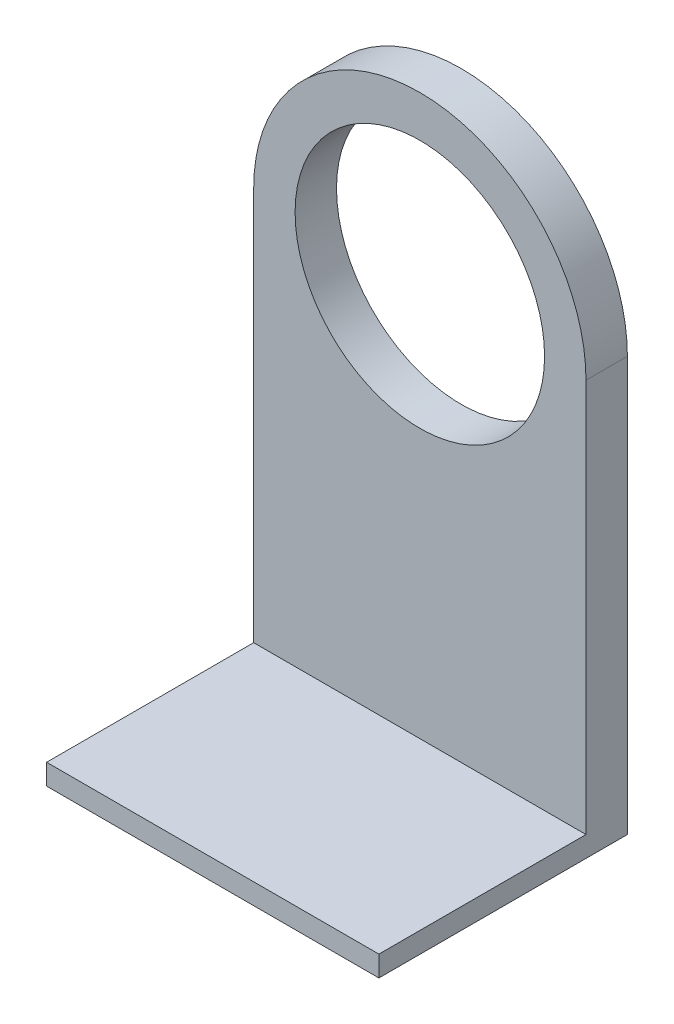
ISO-10303-21;
HEADER;
FILE_DESCRIPTION(('STEP AP214'),'2;1');
FILE_NAME('part.step','',(''),(''),'','','');
FILE_SCHEMA(('AUTOMOTIVE_DESIGN { 1 0 10303 214 1 1 1 1 }'));
ENDSEC;
DATA;
#1=APPLICATION_CONTEXT('core data for automotive mechanical design processes');
#2=APPLICATION_PROTOCOL_DEFINITION('international standard','automotive_design',2000,#1);
#3=PRODUCT_CONTEXT('',#1,'mechanical');
#4=PRODUCT('Part','Part','',(#3));
#5=PRODUCT_RELATED_PRODUCT_CATEGORY('part','',(#4));
#6=PRODUCT_DEFINITION_FORMATION('','',#4);
#7=PRODUCT_DEFINITION_CONTEXT('part definition',#1,'design');
#8=PRODUCT_DEFINITION('design','',#6,#7);
#9=PRODUCT_DEFINITION_SHAPE('','',#8);
#10=(LENGTH_UNIT() NAMED_UNIT(*) SI_UNIT(.MILLI.,.METRE.));
#11=(NAMED_UNIT(*) PLANE_ANGLE_UNIT() SI_UNIT($,.RADIAN.));
#12=(NAMED_UNIT(*) SI_UNIT($,.STERADIAN.) SOLID_ANGLE_UNIT());
#13=UNCERTAINTY_MEASURE_WITH_UNIT(LENGTH_MEASURE(1.E-05),#10,'distance_accuracy_value','');
#14=(GEOMETRIC_REPRESENTATION_CONTEXT(3) GLOBAL_UNCERTAINTY_ASSIGNED_CONTEXT((#13)) GLOBAL_UNIT_ASSIGNED_CONTEXT((#10,
#11,#12)) REPRESENTATION_CONTEXT('',''));
#15=CARTESIAN_POINT('',(0.,0.,0.));
#16=DIRECTION('',(0.,0.,1.));
#17=DIRECTION('',(1.,0.,0.));
#18=AXIS2_PLACEMENT_3D('',#15,#16,#17);
#19=CARTESIAN_POINT('',(0.,-1.83880688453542E-13,12.6999999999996));
#20=DIRECTION('',(0.,0.,1.));
#21=DIRECTION('',(1.,0.,0.));
#22=AXIS2_PLACEMENT_3D('',#19,#20,#21);
#23=PLANE('',#22);
#24=DIRECTION('',(-1.,0.,0.));
#25=VECTOR('',#24,1.);
#26=CARTESIAN_POINT('',(-50.95,-120.65,12.7));
#27=LINE('',#26,#25);
#28=CARTESIAN_POINT('',(50.9500000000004,-120.650000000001,12.7));
#29=VERTEX_POINT('',#28);
#30=CARTESIAN_POINT('',(-50.95,-120.65,12.7));
#31=VERTEX_POINT('',#30);
#32=EDGE_CURVE('E47',#29,#31,#27,.T.);
#33=ORIENTED_EDGE('',*,*,#32,.F.);
#34=DIRECTION('',(0.,1.,0.));
#35=VECTOR('',#34,1.);
#36=CARTESIAN_POINT('',(50.95,0.,12.6999999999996));
#37=LINE('',#36,#35);
#38=CARTESIAN_POINT('',(50.95,0.,12.6999999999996));
#39=VERTEX_POINT('',#38);
#40=EDGE_CURVE('E52',#29,#39,#37,.T.);
#41=ORIENTED_EDGE('',*,*,#40,.T.);
#42=CARTESIAN_POINT('',(0.,-1.83880688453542E-13,12.6999999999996));
#43=DIRECTION('',(0.,0.,1.));
#44=DIRECTION('',(1.,0.,0.));
#45=AXIS2_PLACEMENT_3D('',#42,#43,#44);
#46=CIRCLE('',#45,50.95);
#47=CARTESIAN_POINT('',(-50.95,-1.76941794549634E-13,12.7));
#48=VERTEX_POINT('',#47);
#49=EDGE_CURVE('E83',#39,#48,#46,.T.);
#50=ORIENTED_EDGE('',*,*,#49,.T.);
#51=DIRECTION('',(0.,-1.,0.));
#52=VECTOR('',#51,1.);
#53=CARTESIAN_POINT('',(-50.95,-1.76941794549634E-13,12.7));
#54=LINE('',#53,#52);
#55=EDGE_CURVE('E108',#48,#31,#54,.T.);
#56=ORIENTED_EDGE('',*,*,#55,.T.);
#57=EDGE_LOOP('',(#33,#41,#50,#56));
#58=FACE_BOUND('',#57,.T.);
#59=CARTESIAN_POINT('',(0.,-1.83880688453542E-13,12.6999999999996));
#60=DIRECTION('',(0.,0.,1.));
#61=DIRECTION('',(1.,0.,0.));
#62=AXIS2_PLACEMENT_3D('',#59,#60,#61);
#63=CIRCLE('',#62,38.25);
#64=CARTESIAN_POINT('',(38.25,-1.83880688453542E-13,12.6999999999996));
#65=VERTEX_POINT('',#64);
#66=EDGE_CURVE('E94',#65,#65,#63,.T.);
#67=ORIENTED_EDGE('',*,*,#66,.F.);
#68=EDGE_LOOP('',(#67));
#69=FACE_BOUND('',#68,.T.);
#70=ADVANCED_FACE('F30',(#58,#69),#23,.T.);
#71=CARTESIAN_POINT('',(0.,-1.83880688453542E-13,-3.67761376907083E-13));
#72=DIRECTION('',(0.,0.,1.));
#73=DIRECTION('',(1.,0.,0.));
#74=AXIS2_PLACEMENT_3D('',#71,#72,#73);
#75=PLANE('',#74);
#76=CARTESIAN_POINT('',(0.,-1.83880688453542E-13,-3.67761376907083E-13));
#77=DIRECTION('',(0.,0.,1.));
#78=DIRECTION('',(1.,0.,0.));
#79=AXIS2_PLACEMENT_3D('',#76,#77,#78);
#80=CIRCLE('',#79,50.95);
#81=CARTESIAN_POINT('',(50.95,-1.76941794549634E-13,-3.67761376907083E-13));
#82=VERTEX_POINT('',#81);
#83=CARTESIAN_POINT('',(-50.95,-1.76941794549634E-13,0.));
#84=VERTEX_POINT('',#83);
#85=EDGE_CURVE('E89',#82,#84,#80,.T.);
#86=ORIENTED_EDGE('',*,*,#85,.F.);
#87=DIRECTION('',(0.,1.,0.));
#88=VECTOR('',#87,1.);
#89=CARTESIAN_POINT('',(50.95,-1.76941794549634E-13,-3.67761376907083E-13));
#90=LINE('',#89,#88);
#91=CARTESIAN_POINT('',(50.95,-127.,0.));
#92=VERTEX_POINT('',#91);
#93=EDGE_CURVE('E72',#92,#82,#90,.T.);
#94=ORIENTED_EDGE('',*,*,#93,.F.);
#95=DIRECTION('',(1.,0.,0.));
#96=VECTOR('',#95,1.);
#97=CARTESIAN_POINT('',(50.95,-127.,0.));
#98=LINE('',#97,#96);
#99=CARTESIAN_POINT('',(-50.95,-127.,0.));
#100=VERTEX_POINT('',#99);
#101=EDGE_CURVE('E84',#100,#92,#98,.T.);
#102=ORIENTED_EDGE('',*,*,#101,.F.);
#103=DIRECTION('',(0.,-1.,0.));
#104=VECTOR('',#103,1.);
#105=CARTESIAN_POINT('',(-50.95,-1.76941794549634E-13,0.));
#106=LINE('',#105,#104);
#107=EDGE_CURVE('E93',#84,#100,#106,.T.);
#108=ORIENTED_EDGE('',*,*,#107,.F.);
#109=EDGE_LOOP('',(#86,#94,#102,#108));
#110=FACE_BOUND('',#109,.T.);
#111=CARTESIAN_POINT('',(0.,-1.83880688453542E-13,-3.67761376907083E-13));
#112=DIRECTION('',(0.,0.,1.));
#113=DIRECTION('',(1.,0.,0.));
#114=AXIS2_PLACEMENT_3D('',#111,#112,#113);
#115=CIRCLE('',#114,38.25);
#116=CARTESIAN_POINT('',(38.25,-1.83880688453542E-13,-3.67761376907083E-13));
#117=VERTEX_POINT('',#116);
#118=EDGE_CURVE('E98',#117,#117,#115,.T.);
#119=ORIENTED_EDGE('',*,*,#118,.T.);
#120=EDGE_LOOP('',(#119));
#121=FACE_BOUND('',#120,.T.);
#122=ADVANCED_FACE('F91',(#110,#121),#75,.F.);
#123=CARTESIAN_POINT('',(0.,-1.83880688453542E-13,12.6999999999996));
#124=DIRECTION('',(0.,0.,-1.));
#125=DIRECTION('',(-1.,0.,0.));
#126=AXIS2_PLACEMENT_3D('',#123,#124,#125);
#127=CYLINDRICAL_SURFACE('',#126,50.95);
#128=ORIENTED_EDGE('',*,*,#85,.T.);
#129=DIRECTION('',(0.,0.,-1.));
#130=VECTOR('',#129,1.);
#131=CARTESIAN_POINT('',(-50.95,-1.76941794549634E-13,12.7));
#132=LINE('',#131,#130);
#133=EDGE_CURVE('E11',#48,#84,#132,.T.);
#134=ORIENTED_EDGE('',*,*,#133,.F.);
#135=ORIENTED_EDGE('',*,*,#49,.F.);
#136=DIRECTION('',(0.,0.,-1.));
#137=VECTOR('',#136,1.);
#138=CARTESIAN_POINT('',(50.95,0.,12.6999999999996));
#139=LINE('',#138,#137);
#140=EDGE_CURVE('E75',#39,#82,#139,.T.);
#141=ORIENTED_EDGE('',*,*,#140,.T.);
#142=EDGE_LOOP('',(#128,#134,#135,#141));
#143=FACE_BOUND('',#142,.T.);
#144=ADVANCED_FACE('F32',(#143),#127,.T.);
#145=CARTESIAN_POINT('',(-50.95,-1.76941794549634E-13,12.7));
#146=DIRECTION('',(1.,0.,0.));
#147=DIRECTION('',(0.,1.,0.));
#148=AXIS2_PLACEMENT_3D('',#145,#146,#147);
#149=PLANE('',#148);
#150=ORIENTED_EDGE('',*,*,#107,.T.);
#151=DIRECTION('',(0.,0.,-1.));
#152=VECTOR('',#151,1.);
#153=CARTESIAN_POINT('',(-50.95,-127.,12.7));
#154=LINE('',#153,#152);
#155=CARTESIAN_POINT('',(-50.95,-127.,76.2));
#156=VERTEX_POINT('',#155);
#157=EDGE_CURVE('E39',#156,#100,#154,.T.);
#158=ORIENTED_EDGE('',*,*,#157,.F.);
#159=DIRECTION('',(0.,-1.,0.));
#160=VECTOR('',#159,1.);
#161=CARTESIAN_POINT('',(-50.95,-120.65,76.2));
#162=LINE('',#161,#160);
#163=CARTESIAN_POINT('',(-50.95,-120.65,76.2));
#164=VERTEX_POINT('',#163);
#165=EDGE_CURVE('E122',#164,#156,#162,.T.);
#166=ORIENTED_EDGE('',*,*,#165,.F.);
#167=DIRECTION('',(0.,0.,-1.));
#168=VECTOR('',#167,1.);
#169=CARTESIAN_POINT('',(-50.95,-120.65,76.2));
#170=LINE('',#169,#168);
#171=EDGE_CURVE('E123',#164,#31,#170,.T.);
#172=ORIENTED_EDGE('',*,*,#171,.T.);
#173=ORIENTED_EDGE('',*,*,#55,.F.);
#174=ORIENTED_EDGE('',*,*,#133,.T.);
#175=EDGE_LOOP('',(#150,#158,#166,#172,#173,#174));
#176=FACE_BOUND('',#175,.T.);
#177=ADVANCED_FACE('F150',(#176),#149,.F.);
#178=CARTESIAN_POINT('',(50.95,-127.,12.7));
#179=DIRECTION('',(0.,1.,0.));
#180=DIRECTION('',(0.,0.,1.));
#181=AXIS2_PLACEMENT_3D('',#178,#179,#180);
#182=PLANE('',#181);
#183=ORIENTED_EDGE('',*,*,#101,.T.);
#184=DIRECTION('',(0.,0.,-1.));
#185=VECTOR('',#184,1.);
#186=CARTESIAN_POINT('',(50.95,-127.,12.7));
#187=LINE('',#186,#185);
#188=CARTESIAN_POINT('',(50.95,-126.999999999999,76.2));
#189=VERTEX_POINT('',#188);
#190=EDGE_CURVE('E79',#189,#92,#187,.T.);
#191=ORIENTED_EDGE('',*,*,#190,.F.);
#192=DIRECTION('',(1.,0.,0.));
#193=VECTOR('',#192,1.);
#194=CARTESIAN_POINT('',(-50.95,-127.,76.2));
#195=LINE('',#194,#193);
#196=EDGE_CURVE('E153',#156,#189,#195,.T.);
#197=ORIENTED_EDGE('',*,*,#196,.F.);
#198=ORIENTED_EDGE('',*,*,#157,.T.);
#199=EDGE_LOOP('',(#183,#191,#197,#198));
#200=FACE_BOUND('',#199,.T.);
#201=ADVANCED_FACE('F154',(#200),#182,.F.);
#202=CARTESIAN_POINT('',(50.95,0.,12.6999999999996));
#203=DIRECTION('',(-1.,0.,0.));
#204=DIRECTION('',(0.,-1.,0.));
#205=AXIS2_PLACEMENT_3D('',#202,#203,#204);
#206=PLANE('',#205);
#207=ORIENTED_EDGE('',*,*,#93,.T.);
#208=ORIENTED_EDGE('',*,*,#140,.F.);
#209=ORIENTED_EDGE('',*,*,#40,.F.);
#210=DIRECTION('',(0.,0.,-1.));
#211=VECTOR('',#210,1.);
#212=CARTESIAN_POINT('',(50.95,-120.65,76.2));
#213=LINE('',#212,#211);
#214=CARTESIAN_POINT('',(50.95,-120.65,76.2));
#215=VERTEX_POINT('',#214);
#216=EDGE_CURVE('E115',#215,#29,#213,.T.);
#217=ORIENTED_EDGE('',*,*,#216,.F.);
#218=DIRECTION('',(0.,1.,0.));
#219=VECTOR('',#218,1.);
#220=CARTESIAN_POINT('',(50.95,-126.999999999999,76.2));
#221=LINE('',#220,#219);
#222=EDGE_CURVE('E138',#189,#215,#221,.T.);
#223=ORIENTED_EDGE('',*,*,#222,.F.);
#224=ORIENTED_EDGE('',*,*,#190,.T.);
#225=EDGE_LOOP('',(#207,#208,#209,#217,#223,#224));
#226=FACE_BOUND('',#225,.T.);
#227=ADVANCED_FACE('F74',(#226),#206,.F.);
#228=CARTESIAN_POINT('',(0.,-1.83880688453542E-13,12.6999999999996));
#229=DIRECTION('',(0.,0.,-1.));
#230=DIRECTION('',(-1.,0.,0.));
#231=AXIS2_PLACEMENT_3D('',#228,#229,#230);
#232=CYLINDRICAL_SURFACE('',#231,38.25);
#233=ORIENTED_EDGE('',*,*,#66,.T.);
#234=EDGE_LOOP('',(#233));
#235=FACE_BOUND('',#234,.T.);
#236=ORIENTED_EDGE('',*,*,#118,.F.);
#237=EDGE_LOOP('',(#236));
#238=FACE_BOUND('',#237,.T.);
#239=ADVANCED_FACE('F163',(#235,#238),#232,.F.);
#240=CARTESIAN_POINT('',(-50.95,-120.65,76.2));
#241=DIRECTION('',(0.,-1.,0.));
#242=DIRECTION('',(0.,0.,-1.));
#243=AXIS2_PLACEMENT_3D('',#240,#241,#242);
#244=PLANE('',#243);
#245=ORIENTED_EDGE('',*,*,#32,.T.);
#246=ORIENTED_EDGE('',*,*,#171,.F.);
#247=DIRECTION('',(-1.,0.,0.));
#248=VECTOR('',#247,1.);
#249=CARTESIAN_POINT('',(-50.95,-120.65,76.2));
#250=LINE('',#249,#248);
#251=EDGE_CURVE('E119',#215,#164,#250,.T.);
#252=ORIENTED_EDGE('',*,*,#251,.F.);
#253=ORIENTED_EDGE('',*,*,#216,.T.);
#254=EDGE_LOOP('',(#245,#246,#252,#253));
#255=FACE_BOUND('',#254,.T.);
#256=ADVANCED_FACE('F131',(#255),#244,.F.);
#257=CARTESIAN_POINT('',(-50.95,-127.,76.2));
#258=DIRECTION('',(0.,0.,1.));
#259=DIRECTION('',(1.,0.,0.));
#260=AXIS2_PLACEMENT_3D('',#257,#258,#259);
#261=PLANE('',#260);
#262=ORIENTED_EDGE('',*,*,#165,.T.);
#263=ORIENTED_EDGE('',*,*,#196,.T.);
#264=ORIENTED_EDGE('',*,*,#222,.T.);
#265=ORIENTED_EDGE('',*,*,#251,.T.);
#266=EDGE_LOOP('',(#262,#263,#264,#265));
#267=FACE_BOUND('',#266,.T.);
#268=ADVANCED_FACE('F156',(#267),#261,.T.);
#269=CLOSED_SHELL('',(#70,#122,#144,#177,#201,#227,#239,#256,#268));
#270=MANIFOLD_SOLID_BREP('B2',#269);
#271=ADVANCED_BREP_SHAPE_REPRESENTATION('',(#18,#270),#14);
#272=SHAPE_DEFINITION_REPRESENTATION(#9,#271);
ENDSEC;
END-ISO-10303-21;
